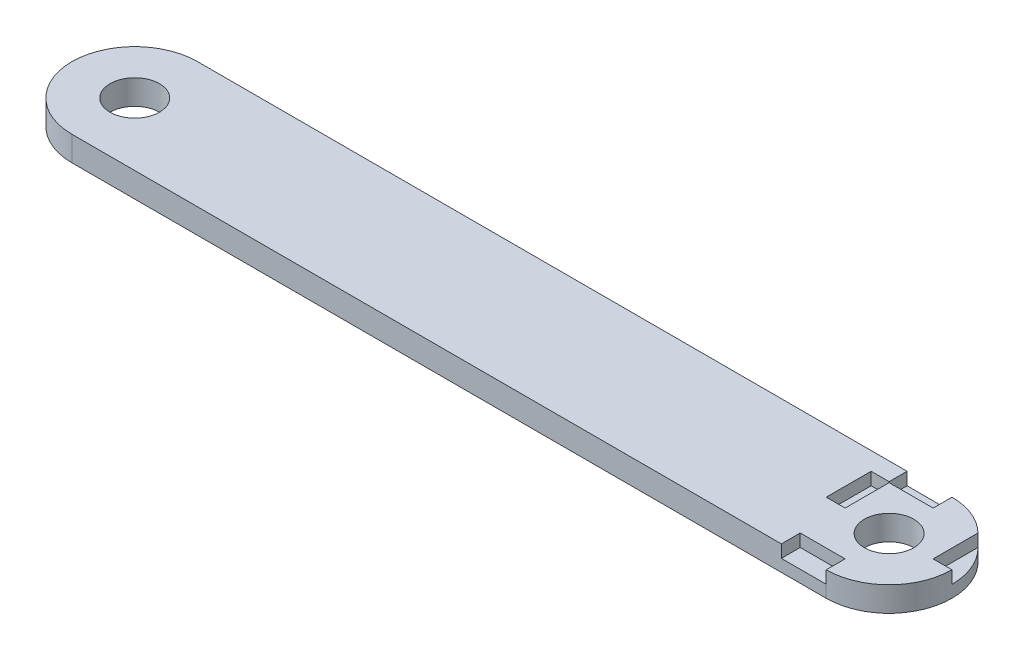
ISO-10303-21;
HEADER;
FILE_DESCRIPTION(('STEP AP214'),'2;1');
FILE_NAME('part.step','',(''),(''),'','','');
FILE_SCHEMA(('AUTOMOTIVE_DESIGN { 1 0 10303 214 1 1 1 1 }'));
ENDSEC;
DATA;
#1=APPLICATION_CONTEXT('core data for automotive mechanical design processes');
#2=APPLICATION_PROTOCOL_DEFINITION('international standard','automotive_design',2000,#1);
#3=PRODUCT_CONTEXT('',#1,'mechanical');
#4=PRODUCT('Part','Part','',(#3));
#5=PRODUCT_RELATED_PRODUCT_CATEGORY('part','',(#4));
#6=PRODUCT_DEFINITION_FORMATION('','',#4);
#7=PRODUCT_DEFINITION_CONTEXT('part definition',#1,'design');
#8=PRODUCT_DEFINITION('design','',#6,#7);
#9=PRODUCT_DEFINITION_SHAPE('','',#8);
#10=(LENGTH_UNIT() NAMED_UNIT(*) SI_UNIT(.MILLI.,.METRE.));
#11=(NAMED_UNIT(*) PLANE_ANGLE_UNIT() SI_UNIT($,.RADIAN.));
#12=(NAMED_UNIT(*) SI_UNIT($,.STERADIAN.) SOLID_ANGLE_UNIT());
#13=UNCERTAINTY_MEASURE_WITH_UNIT(LENGTH_MEASURE(1.E-05),#10,'distance_accuracy_value','');
#14=(GEOMETRIC_REPRESENTATION_CONTEXT(3) GLOBAL_UNCERTAINTY_ASSIGNED_CONTEXT((#13)) GLOBAL_UNIT_ASSIGNED_CONTEXT((#10,
#11,#12)) REPRESENTATION_CONTEXT('',''));
#15=CARTESIAN_POINT('',(0.,0.,0.));
#16=DIRECTION('',(0.,0.,1.));
#17=DIRECTION('',(1.,0.,0.));
#18=AXIS2_PLACEMENT_3D('',#15,#16,#17);
#19=CARTESIAN_POINT('',(-73.5541666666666,5.,1.32291666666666));
#20=DIRECTION('',(0.,-1.,0.));
#21=DIRECTION('',(0.,0.,-1.));
#22=AXIS2_PLACEMENT_3D('',#19,#20,#21);
#23=CYLINDRICAL_SURFACE('',#22,12.7);
#24=CARTESIAN_POINT('',(-73.5541666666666,0.,1.32291666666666));
#25=DIRECTION('',(0.,1.,0.));
#26=DIRECTION('',(0.,0.,-1.));
#27=AXIS2_PLACEMENT_3D('',#24,#25,#26);
#28=CIRCLE('',#27,12.7);
#29=CARTESIAN_POINT('',(-73.5541666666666,0.,-11.3770833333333));
#30=VERTEX_POINT('',#29);
#31=CARTESIAN_POINT('',(-73.5541666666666,0.,14.0229166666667));
#32=VERTEX_POINT('',#31);
#33=EDGE_CURVE('E279',#30,#32,#28,.T.);
#34=ORIENTED_EDGE('',*,*,#33,.T.);
#35=DIRECTION('',(0.,-1.,0.));
#36=VECTOR('',#35,1.);
#37=CARTESIAN_POINT('',(-73.5541666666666,5.,14.0229166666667));
#38=LINE('',#37,#36);
#39=CARTESIAN_POINT('',(-73.5541666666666,5.,14.0229166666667));
#40=VERTEX_POINT('',#39);
#41=EDGE_CURVE('E40',#40,#32,#38,.T.);
#42=ORIENTED_EDGE('',*,*,#41,.F.);
#43=CARTESIAN_POINT('',(-73.5541666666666,5.,1.32291666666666));
#44=DIRECTION('',(0.,1.,0.));
#45=DIRECTION('',(0.,0.,-1.));
#46=AXIS2_PLACEMENT_3D('',#43,#44,#45);
#47=CIRCLE('',#46,12.7);
#48=CARTESIAN_POINT('',(-73.5541666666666,5.,-11.3770833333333));
#49=VERTEX_POINT('',#48);
#50=EDGE_CURVE('E282',#49,#40,#47,.T.);
#51=ORIENTED_EDGE('',*,*,#50,.F.);
#52=DIRECTION('',(0.,-1.,0.));
#53=VECTOR('',#52,1.);
#54=CARTESIAN_POINT('',(-73.5541666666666,5.,-11.3770833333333));
#55=LINE('',#54,#53);
#56=EDGE_CURVE('E295',#49,#30,#55,.T.);
#57=ORIENTED_EDGE('',*,*,#56,.T.);
#58=EDGE_LOOP('',(#34,#42,#51,#57));
#59=FACE_BOUND('',#58,.T.);
#60=ADVANCED_FACE('F33',(#59),#23,.T.);
#61=CARTESIAN_POINT('',(-73.5541666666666,5.,14.0229166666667));
#62=DIRECTION('',(0.,0.,-1.));
#63=DIRECTION('',(-1.,0.,0.));
#64=AXIS2_PLACEMENT_3D('',#61,#62,#63);
#65=PLANE('',#64);
#66=DIRECTION('',(1.,0.,0.));
#67=VECTOR('',#66,1.);
#68=CARTESIAN_POINT('',(78.8458333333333,2.46,14.0229166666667));
#69=LINE('',#68,#67);
#70=CARTESIAN_POINT('',(69.776219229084,2.46,14.0229166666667));
#71=VERTEX_POINT('',#70);
#72=CARTESIAN_POINT('',(78.8458333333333,2.46,14.0229166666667));
#73=VERTEX_POINT('',#72);
#74=EDGE_CURVE('E222',#71,#73,#69,.T.);
#75=ORIENTED_EDGE('',*,*,#74,.F.);
#76=DIRECTION('',(0.,1.,0.));
#77=VECTOR('',#76,1.);
#78=CARTESIAN_POINT('',(69.776219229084,2.46,14.0229166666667));
#79=LINE('',#78,#77);
#80=CARTESIAN_POINT('',(69.776219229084,5.,14.0229166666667));
#81=VERTEX_POINT('',#80);
#82=EDGE_CURVE('E242',#71,#81,#79,.T.);
#83=ORIENTED_EDGE('',*,*,#82,.T.);
#84=DIRECTION('',(1.,0.,0.));
#85=VECTOR('',#84,1.);
#86=CARTESIAN_POINT('',(-73.5541666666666,5.,14.0229166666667));
#87=LINE('',#86,#85);
#88=EDGE_CURVE('E285',#40,#81,#87,.T.);
#89=ORIENTED_EDGE('',*,*,#88,.F.);
#90=ORIENTED_EDGE('',*,*,#41,.T.);
#91=DIRECTION('',(1.,0.,0.));
#92=VECTOR('',#91,1.);
#93=CARTESIAN_POINT('',(-73.5541666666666,0.,14.0229166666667));
#94=LINE('',#93,#92);
#95=CARTESIAN_POINT('',(78.8458333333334,0.,14.0229166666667));
#96=VERTEX_POINT('',#95);
#97=EDGE_CURVE('E298',#32,#96,#94,.T.);
#98=ORIENTED_EDGE('',*,*,#97,.T.);
#99=DIRECTION('',(0.,-1.,0.));
#100=VECTOR('',#99,1.);
#101=CARTESIAN_POINT('',(78.8458333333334,5.,14.0229166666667));
#102=LINE('',#101,#100);
#103=EDGE_CURVE('E310',#73,#96,#102,.T.);
#104=ORIENTED_EDGE('',*,*,#103,.F.);
#105=EDGE_LOOP('',(#75,#83,#89,#90,#98,#104));
#106=FACE_BOUND('',#105,.T.);
#107=ADVANCED_FACE('F317',(#106),#65,.F.);
#108=CARTESIAN_POINT('',(78.8458333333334,5.,1.32291666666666));
#109=DIRECTION('',(0.,-1.,0.));
#110=DIRECTION('',(0.,0.,-1.));
#111=AXIS2_PLACEMENT_3D('',#108,#109,#110);
#112=CYLINDRICAL_SURFACE('',#111,12.7);
#113=CARTESIAN_POINT('',(78.8458333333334,5.,1.32291666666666));
#114=DIRECTION('',(0.,1.,0.));
#115=DIRECTION('',(0.,0.,-1.));
#116=AXIS2_PLACEMENT_3D('',#113,#114,#115);
#117=CIRCLE('',#116,12.7);
#118=CARTESIAN_POINT('',(87.7358333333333,5.,-7.74669743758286));
#119=VERTEX_POINT('',#118);
#120=CARTESIAN_POINT('',(78.8458333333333,5.,-11.3770833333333));
#121=VERTEX_POINT('',#120);
#122=EDGE_CURVE('E289',#119,#121,#117,.T.);
#123=ORIENTED_EDGE('',*,*,#122,.F.);
#124=DIRECTION('',(0.,1.,0.));
#125=VECTOR('',#124,1.);
#126=CARTESIAN_POINT('',(87.7358333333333,2.46,-7.74669743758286));
#127=LINE('',#126,#125);
#128=CARTESIAN_POINT('',(87.7358333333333,2.46,-7.74669743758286));
#129=VERTEX_POINT('',#128);
#130=EDGE_CURVE('E47',#129,#119,#127,.T.);
#131=ORIENTED_EDGE('',*,*,#130,.F.);
#132=CARTESIAN_POINT('',(78.8458333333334,2.46,1.32291666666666));
#133=DIRECTION('',(0.,-1.,0.));
#134=DIRECTION('',(0.,0.,-1.));
#135=AXIS2_PLACEMENT_3D('',#132,#133,#134);
#136=CIRCLE('',#135,12.7);
#137=CARTESIAN_POINT('',(91.5458333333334,2.46,1.32291666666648));
#138=VERTEX_POINT('',#137);
#139=EDGE_CURVE('E11',#129,#138,#136,.T.);
#140=ORIENTED_EDGE('',*,*,#139,.T.);
#141=DIRECTION('',(0.,1.,0.));
#142=VECTOR('',#141,1.);
#143=CARTESIAN_POINT('',(91.5458333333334,2.46,1.32291666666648));
#144=LINE('',#143,#142);
#145=CARTESIAN_POINT('',(91.5458333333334,5.,1.32291666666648));
#146=VERTEX_POINT('',#145);
#147=EDGE_CURVE('E213',#138,#146,#144,.T.);
#148=ORIENTED_EDGE('',*,*,#147,.T.);
#149=CARTESIAN_POINT('',(78.8458333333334,5.,14.0229166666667));
#150=VERTEX_POINT('',#149);
#151=EDGE_CURVE('E290',#150,#146,#117,.T.);
#152=ORIENTED_EDGE('',*,*,#151,.F.);
#153=EDGE_CURVE('E311',#150,#73,#102,.T.);
#154=ORIENTED_EDGE('',*,*,#153,.T.);
#155=ORIENTED_EDGE('',*,*,#103,.T.);
#156=CARTESIAN_POINT('',(78.8458333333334,0.,1.32291666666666));
#157=DIRECTION('',(0.,1.,0.));
#158=DIRECTION('',(0.,0.,-1.));
#159=AXIS2_PLACEMENT_3D('',#156,#157,#158);
#160=CIRCLE('',#159,12.7);
#161=CARTESIAN_POINT('',(78.8458333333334,0.,-11.3770833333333));
#162=VERTEX_POINT('',#161);
#163=EDGE_CURVE('E301',#96,#162,#160,.T.);
#164=ORIENTED_EDGE('',*,*,#163,.T.);
#165=DIRECTION('',(0.,-1.,0.));
#166=VECTOR('',#165,1.);
#167=CARTESIAN_POINT('',(78.8458333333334,5.,-11.3770833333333));
#168=LINE('',#167,#166);
#169=CARTESIAN_POINT('',(78.8458333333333,2.46,-11.3770833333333));
#170=VERTEX_POINT('',#169);
#171=EDGE_CURVE('E307',#170,#162,#168,.T.);
#172=ORIENTED_EDGE('',*,*,#171,.F.);
#173=EDGE_CURVE('E308',#121,#170,#168,.T.);
#174=ORIENTED_EDGE('',*,*,#173,.F.);
#175=EDGE_LOOP('',(#123,#131,#140,#148,#152,#154,#155,#164,#172,#174));
#176=FACE_BOUND('',#175,.T.);
#177=ADVANCED_FACE('F330',(#176),#112,.T.);
#178=CARTESIAN_POINT('',(-73.5541666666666,5.,-11.3770833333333));
#179=DIRECTION('',(0.,0.,1.));
#180=DIRECTION('',(1.,0.,0.));
#181=AXIS2_PLACEMENT_3D('',#178,#179,#180);
#182=PLANE('',#181);
#183=DIRECTION('',(-1.,0.,0.));
#184=VECTOR('',#183,1.);
#185=CARTESIAN_POINT('',(-73.5541666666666,5.,-11.3770833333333));
#186=LINE('',#185,#184);
#187=CARTESIAN_POINT('',(69.7762192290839,5.,-11.3770833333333));
#188=VERTEX_POINT('',#187);
#189=EDGE_CURVE('E293',#188,#49,#186,.T.);
#190=ORIENTED_EDGE('',*,*,#189,.F.);
#191=DIRECTION('',(0.,1.,0.));
#192=VECTOR('',#191,1.);
#193=CARTESIAN_POINT('',(69.776219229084,2.46,-11.3770833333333));
#194=LINE('',#193,#192);
#195=CARTESIAN_POINT('',(69.776219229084,2.46,-11.3770833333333));
#196=VERTEX_POINT('',#195);
#197=EDGE_CURVE('E55',#196,#188,#194,.T.);
#198=ORIENTED_EDGE('',*,*,#197,.F.);
#199=DIRECTION('',(-1.,0.,0.));
#200=VECTOR('',#199,1.);
#201=CARTESIAN_POINT('',(78.8458333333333,2.46,-11.3770833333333));
#202=LINE('',#201,#200);
#203=EDGE_CURVE('E252',#170,#196,#202,.T.);
#204=ORIENTED_EDGE('',*,*,#203,.F.);
#205=ORIENTED_EDGE('',*,*,#171,.T.);
#206=DIRECTION('',(-1.,0.,0.));
#207=VECTOR('',#206,1.);
#208=CARTESIAN_POINT('',(-73.5541666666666,0.,-11.3770833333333));
#209=LINE('',#208,#207);
#210=EDGE_CURVE('E286',#162,#30,#209,.T.);
#211=ORIENTED_EDGE('',*,*,#210,.T.);
#212=ORIENTED_EDGE('',*,*,#56,.F.);
#213=EDGE_LOOP('',(#190,#198,#204,#205,#211,#212));
#214=FACE_BOUND('',#213,.T.);
#215=ADVANCED_FACE('F347',(#214),#182,.F.);
#216=CARTESIAN_POINT('',(-73.5541666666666,5.,1.32291666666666));
#217=DIRECTION('',(0.,-1.,0.));
#218=DIRECTION('',(0.,0.,-1.));
#219=AXIS2_PLACEMENT_3D('',#216,#217,#218);
#220=PLANE('',#219);
#221=CARTESIAN_POINT('',(78.8458333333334,5.,1.32291666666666));
#222=DIRECTION('',(0.,1.,0.));
#223=DIRECTION('',(0.,0.,1.));
#224=AXIS2_PLACEMENT_3D('',#221,#222,#223);
#225=CIRCLE('',#224,5.);
#226=CARTESIAN_POINT('',(78.8458333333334,5.,6.32291666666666));
#227=VERTEX_POINT('',#226);
#228=EDGE_CURVE('E270',#227,#227,#225,.T.);
#229=ORIENTED_EDGE('',*,*,#228,.F.);
#230=EDGE_LOOP('',(#229));
#231=FACE_BOUND('',#230,.T.);
#232=CARTESIAN_POINT('',(-73.5541666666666,5.,1.32291666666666));
#233=DIRECTION('',(0.,1.,0.));
#234=DIRECTION('',(0.,0.,1.));
#235=AXIS2_PLACEMENT_3D('',#232,#233,#234);
#236=CIRCLE('',#235,5.);
#237=CARTESIAN_POINT('',(-73.5541666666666,5.,6.32291666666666));
#238=VERTEX_POINT('',#237);
#239=EDGE_CURVE('E276',#238,#238,#236,.T.);
#240=ORIENTED_EDGE('',*,*,#239,.F.);
#241=EDGE_LOOP('',(#240));
#242=FACE_BOUND('',#241,.T.);
#243=DIRECTION('',(0.,0.,1.));
#244=VECTOR('',#243,1.);
#245=CARTESIAN_POINT('',(66.1458333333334,5.,1.32291666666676));
#246=LINE('',#245,#244);
#247=CARTESIAN_POINT('',(66.1458333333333,5.,-7.74669743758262));
#248=VERTEX_POINT('',#247);
#249=CARTESIAN_POINT('',(66.1458333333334,5.,1.32291666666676));
#250=VERTEX_POINT('',#249);
#251=EDGE_CURVE('E167',#248,#250,#246,.T.);
#252=ORIENTED_EDGE('',*,*,#251,.F.);
#253=DIRECTION('',(-1.,0.,0.));
#254=VECTOR('',#253,1.);
#255=CARTESIAN_POINT('',(66.1458333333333,5.,-7.74669743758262));
#256=LINE('',#255,#254);
#257=CARTESIAN_POINT('',(69.776219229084,5.,-7.74669743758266));
#258=VERTEX_POINT('',#257);
#259=EDGE_CURVE('E185',#258,#248,#256,.T.);
#260=ORIENTED_EDGE('',*,*,#259,.F.);
#261=DIRECTION('',(0.,0.,1.));
#262=VECTOR('',#261,1.);
#263=CARTESIAN_POINT('',(69.776219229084,5.,-11.3770833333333));
#264=LINE('',#263,#262);
#265=EDGE_CURVE('E262',#188,#258,#264,.T.);
#266=ORIENTED_EDGE('',*,*,#265,.F.);
#267=ORIENTED_EDGE('',*,*,#189,.T.);
#268=ORIENTED_EDGE('',*,*,#50,.T.);
#269=ORIENTED_EDGE('',*,*,#88,.T.);
#270=DIRECTION('',(0.,0.,1.));
#271=VECTOR('',#270,1.);
#272=CARTESIAN_POINT('',(69.776219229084,5.,14.0229166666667));
#273=LINE('',#272,#271);
#274=CARTESIAN_POINT('',(69.776219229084,5.,10.2129166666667));
#275=VERTEX_POINT('',#274);
#276=EDGE_CURVE('E226',#275,#81,#273,.T.);
#277=ORIENTED_EDGE('',*,*,#276,.F.);
#278=DIRECTION('',(-1.,0.,0.));
#279=VECTOR('',#278,1.);
#280=CARTESIAN_POINT('',(78.8458333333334,5.,10.2129166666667));
#281=LINE('',#280,#279);
#282=CARTESIAN_POINT('',(78.8458333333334,5.,10.2129166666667));
#283=VERTEX_POINT('',#282);
#284=EDGE_CURVE('E238',#283,#275,#281,.T.);
#285=ORIENTED_EDGE('',*,*,#284,.F.);
#286=DIRECTION('',(0.,0.,-1.));
#287=VECTOR('',#286,1.);
#288=CARTESIAN_POINT('',(78.8458333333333,5.,14.0229166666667));
#289=LINE('',#288,#287);
#290=EDGE_CURVE('E218',#150,#283,#289,.T.);
#291=ORIENTED_EDGE('',*,*,#290,.F.);
#292=ORIENTED_EDGE('',*,*,#151,.T.);
#293=DIRECTION('',(1.,0.,0.));
#294=VECTOR('',#293,1.);
#295=CARTESIAN_POINT('',(91.5458333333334,5.,1.32291666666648));
#296=LINE('',#295,#294);
#297=CARTESIAN_POINT('',(87.7358333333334,5.,1.32291666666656));
#298=VERTEX_POINT('',#297);
#299=EDGE_CURVE('E205',#298,#146,#296,.T.);
#300=ORIENTED_EDGE('',*,*,#299,.F.);
#301=DIRECTION('',(0.,0.,1.));
#302=VECTOR('',#301,1.);
#303=CARTESIAN_POINT('',(87.7358333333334,5.,1.32291666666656));
#304=LINE('',#303,#302);
#305=EDGE_CURVE('E210',#119,#298,#304,.T.);
#306=ORIENTED_EDGE('',*,*,#305,.F.);
#307=ORIENTED_EDGE('',*,*,#122,.T.);
#308=DIRECTION('',(0.,0.,-1.));
#309=VECTOR('',#308,1.);
#310=CARTESIAN_POINT('',(78.8458333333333,5.,-11.3770833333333));
#311=LINE('',#310,#309);
#312=CARTESIAN_POINT('',(78.8458333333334,5.,-7.56708333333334));
#313=VERTEX_POINT('',#312);
#314=EDGE_CURVE('E245',#313,#121,#311,.T.);
#315=ORIENTED_EDGE('',*,*,#314,.F.);
#316=DIRECTION('',(1.,0.,0.));
#317=VECTOR('',#316,1.);
#318=CARTESIAN_POINT('',(78.8458333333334,5.,-7.56708333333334));
#319=LINE('',#318,#317);
#320=CARTESIAN_POINT('',(69.9558333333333,5.,-7.56708333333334));
#321=VERTEX_POINT('',#320);
#322=EDGE_CURVE('E253',#321,#313,#319,.T.);
#323=ORIENTED_EDGE('',*,*,#322,.F.);
#324=DIRECTION('',(0.,0.,-1.));
#325=VECTOR('',#324,1.);
#326=CARTESIAN_POINT('',(69.9558333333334,5.,1.32291666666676));
#327=LINE('',#326,#325);
#328=CARTESIAN_POINT('',(69.9558333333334,5.,1.32291666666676));
#329=VERTEX_POINT('',#328);
#330=EDGE_CURVE('E187',#329,#321,#327,.T.);
#331=ORIENTED_EDGE('',*,*,#330,.F.);
#332=DIRECTION('',(1.,0.,0.));
#333=VECTOR('',#332,1.);
#334=CARTESIAN_POINT('',(66.1458333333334,5.,1.32291666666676));
#335=LINE('',#334,#333);
#336=EDGE_CURVE('E193',#250,#329,#335,.T.);
#337=ORIENTED_EDGE('',*,*,#336,.F.);
#338=EDGE_LOOP('',(#252,#260,#266,#267,#268,#269,#277,#285,#291,#292,#300,#306,#307,#315,#323,
#331,#337));
#339=FACE_BOUND('',#338,.T.);
#340=ADVANCED_FACE('F342',(#231,#242,#339),#220,.F.);
#341=CARTESIAN_POINT('',(-73.5541666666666,0.,1.32291666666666));
#342=DIRECTION('',(0.,-1.,0.));
#343=DIRECTION('',(0.,0.,-1.));
#344=AXIS2_PLACEMENT_3D('',#341,#342,#343);
#345=PLANE('',#344);
#346=CARTESIAN_POINT('',(78.8458333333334,0.,1.32291666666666));
#347=DIRECTION('',(0.,1.,0.));
#348=DIRECTION('',(0.,0.,1.));
#349=AXIS2_PLACEMENT_3D('',#346,#347,#348);
#350=CIRCLE('',#349,5.);
#351=CARTESIAN_POINT('',(78.8458333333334,0.,6.32291666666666));
#352=VERTEX_POINT('',#351);
#353=EDGE_CURVE('E268',#352,#352,#350,.T.);
#354=ORIENTED_EDGE('',*,*,#353,.T.);
#355=EDGE_LOOP('',(#354));
#356=FACE_BOUND('',#355,.T.);
#357=CARTESIAN_POINT('',(-73.5541666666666,0.,1.32291666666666));
#358=DIRECTION('',(0.,1.,0.));
#359=DIRECTION('',(0.,0.,1.));
#360=AXIS2_PLACEMENT_3D('',#357,#358,#359);
#361=CIRCLE('',#360,5.);
#362=CARTESIAN_POINT('',(-73.5541666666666,0.,6.32291666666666));
#363=VERTEX_POINT('',#362);
#364=EDGE_CURVE('E273',#363,#363,#361,.T.);
#365=ORIENTED_EDGE('',*,*,#364,.T.);
#366=EDGE_LOOP('',(#365));
#367=FACE_BOUND('',#366,.T.);
#368=ORIENTED_EDGE('',*,*,#33,.F.);
#369=ORIENTED_EDGE('',*,*,#210,.F.);
#370=ORIENTED_EDGE('',*,*,#163,.F.);
#371=ORIENTED_EDGE('',*,*,#97,.F.);
#372=EDGE_LOOP('',(#368,#369,#370,#371));
#373=FACE_BOUND('',#372,.T.);
#374=ADVANCED_FACE('F326',(#356,#367,#373),#345,.T.);
#375=CARTESIAN_POINT('',(-73.5541666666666,5.,1.32291666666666));
#376=DIRECTION('',(0.,-1.,0.));
#377=DIRECTION('',(0.,0.,-1.));
#378=AXIS2_PLACEMENT_3D('',#375,#376,#377);
#379=CYLINDRICAL_SURFACE('',#378,5.);
#380=ORIENTED_EDGE('',*,*,#239,.T.);
#381=EDGE_LOOP('',(#380));
#382=FACE_BOUND('',#381,.T.);
#383=ORIENTED_EDGE('',*,*,#364,.F.);
#384=EDGE_LOOP('',(#383));
#385=FACE_BOUND('',#384,.T.);
#386=ADVANCED_FACE('F389',(#382,#385),#379,.F.);
#387=CARTESIAN_POINT('',(78.8458333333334,5.,1.32291666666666));
#388=DIRECTION('',(0.,-1.,0.));
#389=DIRECTION('',(0.,0.,-1.));
#390=AXIS2_PLACEMENT_3D('',#387,#388,#389);
#391=CYLINDRICAL_SURFACE('',#390,5.);
#392=ORIENTED_EDGE('',*,*,#228,.T.);
#393=EDGE_LOOP('',(#392));
#394=FACE_BOUND('',#393,.T.);
#395=ORIENTED_EDGE('',*,*,#353,.F.);
#396=EDGE_LOOP('',(#395));
#397=FACE_BOUND('',#396,.T.);
#398=ADVANCED_FACE('F396',(#394,#397),#391,.F.);
#399=CARTESIAN_POINT('',(78.8458333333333,2.46,-11.3770833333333));
#400=DIRECTION('',(1.,0.,0.));
#401=DIRECTION('',(0.,0.,-1.));
#402=AXIS2_PLACEMENT_3D('',#399,#400,#401);
#403=PLANE('',#402);
#404=ORIENTED_EDGE('',*,*,#314,.T.);
#405=ORIENTED_EDGE('',*,*,#173,.T.);
#406=DIRECTION('',(0.,0.,-1.));
#407=VECTOR('',#406,1.);
#408=CARTESIAN_POINT('',(78.8458333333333,2.46,-11.3770833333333));
#409=LINE('',#408,#407);
#410=CARTESIAN_POINT('',(78.8458333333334,2.46,-7.56708333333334));
#411=VERTEX_POINT('',#410);
#412=EDGE_CURVE('E249',#411,#170,#409,.T.);
#413=ORIENTED_EDGE('',*,*,#412,.F.);
#414=DIRECTION('',(0.,1.,0.));
#415=VECTOR('',#414,1.);
#416=CARTESIAN_POINT('',(78.8458333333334,2.46,-7.56708333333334));
#417=LINE('',#416,#415);
#418=EDGE_CURVE('E265',#411,#313,#417,.T.);
#419=ORIENTED_EDGE('',*,*,#418,.T.);
#420=EDGE_LOOP('',(#404,#405,#413,#419));
#421=FACE_BOUND('',#420,.T.);
#422=ADVANCED_FACE('F353',(#421),#403,.F.);
#423=CARTESIAN_POINT('',(78.8458333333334,2.46,-7.56708333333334));
#424=DIRECTION('',(0.,0.,1.));
#425=DIRECTION('',(1.,0.,0.));
#426=AXIS2_PLACEMENT_3D('',#423,#424,#425);
#427=PLANE('',#426);
#428=DIRECTION('',(1.,0.,0.));
#429=VECTOR('',#428,1.);
#430=CARTESIAN_POINT('',(78.8458333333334,2.46,-7.56708333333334));
#431=LINE('',#430,#429);
#432=CARTESIAN_POINT('',(69.9558333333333,2.46,-7.56708333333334));
#433=VERTEX_POINT('',#432);
#434=EDGE_CURVE('E258',#433,#411,#431,.T.);
#435=ORIENTED_EDGE('',*,*,#434,.F.);
#436=DIRECTION('',(0.,1.,0.));
#437=VECTOR('',#436,1.);
#438=CARTESIAN_POINT('',(69.9558333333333,2.46,-7.56708333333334));
#439=LINE('',#438,#437);
#440=EDGE_CURVE('E198',#433,#321,#439,.T.);
#441=ORIENTED_EDGE('',*,*,#440,.T.);
#442=ORIENTED_EDGE('',*,*,#322,.T.);
#443=ORIENTED_EDGE('',*,*,#418,.F.);
#444=EDGE_LOOP('',(#435,#441,#442,#443));
#445=FACE_BOUND('',#444,.T.);
#446=ADVANCED_FACE('F403',(#445),#427,.F.);
#447=CARTESIAN_POINT('',(69.776219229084,2.46,-11.3770833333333));
#448=DIRECTION('',(-1.,0.,0.));
#449=DIRECTION('',(0.,0.,1.));
#450=AXIS2_PLACEMENT_3D('',#447,#448,#449);
#451=PLANE('',#450);
#452=ORIENTED_EDGE('',*,*,#265,.T.);
#453=DIRECTION('',(0.,-1.,0.));
#454=VECTOR('',#453,1.);
#455=CARTESIAN_POINT('',(69.776219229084,2.46,-7.74669743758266));
#456=LINE('',#455,#454);
#457=CARTESIAN_POINT('',(69.776219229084,2.46,-7.74669743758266));
#458=VERTEX_POINT('',#457);
#459=EDGE_CURVE('E202',#258,#458,#456,.T.);
#460=ORIENTED_EDGE('',*,*,#459,.T.);
#461=DIRECTION('',(0.,0.,1.));
#462=VECTOR('',#461,1.);
#463=CARTESIAN_POINT('',(69.776219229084,2.46,-11.3770833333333));
#464=LINE('',#463,#462);
#465=EDGE_CURVE('E256',#196,#458,#464,.T.);
#466=ORIENTED_EDGE('',*,*,#465,.F.);
#467=ORIENTED_EDGE('',*,*,#197,.T.);
#468=EDGE_LOOP('',(#452,#460,#466,#467));
#469=FACE_BOUND('',#468,.T.);
#470=ADVANCED_FACE('F404',(#469),#451,.F.);
#471=CARTESIAN_POINT('',(0.,2.46,0.));
#472=DIRECTION('',(0.,-1.,0.));
#473=DIRECTION('',(0.,0.,-1.));
#474=AXIS2_PLACEMENT_3D('',#471,#472,#473);
#475=PLANE('',#474);
#476=DIRECTION('',(0.,0.,-1.));
#477=VECTOR('',#476,1.);
#478=CARTESIAN_POINT('',(69.9558333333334,2.46,1.32291666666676));
#479=LINE('',#478,#477);
#480=CARTESIAN_POINT('',(69.9558333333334,2.46,1.32291666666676));
#481=VERTEX_POINT('',#480);
#482=EDGE_CURVE('E180',#481,#433,#479,.T.);
#483=ORIENTED_EDGE('',*,*,#482,.T.);
#484=ORIENTED_EDGE('',*,*,#434,.T.);
#485=ORIENTED_EDGE('',*,*,#412,.T.);
#486=ORIENTED_EDGE('',*,*,#203,.T.);
#487=ORIENTED_EDGE('',*,*,#465,.T.);
#488=DIRECTION('',(-1.,0.,0.));
#489=VECTOR('',#488,1.);
#490=CARTESIAN_POINT('',(66.1458333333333,2.46,-7.74669743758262));
#491=LINE('',#490,#489);
#492=CARTESIAN_POINT('',(66.1458333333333,2.46,-7.74669743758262));
#493=VERTEX_POINT('',#492);
#494=EDGE_CURVE('E172',#458,#493,#491,.T.);
#495=ORIENTED_EDGE('',*,*,#494,.T.);
#496=DIRECTION('',(0.,0.,1.));
#497=VECTOR('',#496,1.);
#498=CARTESIAN_POINT('',(66.1458333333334,2.46,1.32291666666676));
#499=LINE('',#498,#497);
#500=CARTESIAN_POINT('',(66.1458333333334,2.46,1.32291666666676));
#501=VERTEX_POINT('',#500);
#502=EDGE_CURVE('E165',#493,#501,#499,.T.);
#503=ORIENTED_EDGE('',*,*,#502,.T.);
#504=DIRECTION('',(1.,0.,0.));
#505=VECTOR('',#504,1.);
#506=CARTESIAN_POINT('',(66.1458333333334,2.46,1.32291666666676));
#507=LINE('',#506,#505);
#508=EDGE_CURVE('E175',#501,#481,#507,.T.);
#509=ORIENTED_EDGE('',*,*,#508,.T.);
#510=EDGE_LOOP('',(#483,#484,#485,#486,#487,#495,#503,#509));
#511=FACE_BOUND('',#510,.T.);
#512=ADVANCED_FACE('F182',(#511),#475,.F.);
#513=CARTESIAN_POINT('',(69.776219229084,2.46,14.0229166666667));
#514=DIRECTION('',(-1.,0.,0.));
#515=DIRECTION('',(0.,0.,1.));
#516=AXIS2_PLACEMENT_3D('',#513,#514,#515);
#517=PLANE('',#516);
#518=ORIENTED_EDGE('',*,*,#276,.T.);
#519=ORIENTED_EDGE('',*,*,#82,.F.);
#520=DIRECTION('',(0.,0.,1.));
#521=VECTOR('',#520,1.);
#522=CARTESIAN_POINT('',(69.776219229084,2.46,14.0229166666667));
#523=LINE('',#522,#521);
#524=CARTESIAN_POINT('',(69.776219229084,2.46,10.2129166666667));
#525=VERTEX_POINT('',#524);
#526=EDGE_CURVE('E232',#525,#71,#523,.T.);
#527=ORIENTED_EDGE('',*,*,#526,.F.);
#528=DIRECTION('',(0.,1.,0.));
#529=VECTOR('',#528,1.);
#530=CARTESIAN_POINT('',(69.776219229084,2.46,10.2129166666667));
#531=LINE('',#530,#529);
#532=EDGE_CURVE('E246',#525,#275,#531,.T.);
#533=ORIENTED_EDGE('',*,*,#532,.T.);
#534=EDGE_LOOP('',(#518,#519,#527,#533));
#535=FACE_BOUND('',#534,.T.);
#536=ADVANCED_FACE('F338',(#535),#517,.F.);
#537=CARTESIAN_POINT('',(78.8458333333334,2.46,10.2129166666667));
#538=DIRECTION('',(0.,0.,-1.));
#539=DIRECTION('',(-1.,0.,0.));
#540=AXIS2_PLACEMENT_3D('',#537,#538,#539);
#541=PLANE('',#540);
#542=ORIENTED_EDGE('',*,*,#284,.T.);
#543=ORIENTED_EDGE('',*,*,#532,.F.);
#544=DIRECTION('',(-1.,0.,0.));
#545=VECTOR('',#544,1.);
#546=CARTESIAN_POINT('',(78.8458333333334,2.46,10.2129166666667));
#547=LINE('',#546,#545);
#548=CARTESIAN_POINT('',(78.8458333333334,2.46,10.2129166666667));
#549=VERTEX_POINT('',#548);
#550=EDGE_CURVE('E229',#549,#525,#547,.T.);
#551=ORIENTED_EDGE('',*,*,#550,.F.);
#552=DIRECTION('',(0.,1.,0.));
#553=VECTOR('',#552,1.);
#554=CARTESIAN_POINT('',(78.8458333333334,2.46,10.2129166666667));
#555=LINE('',#554,#553);
#556=EDGE_CURVE('E235',#549,#283,#555,.T.);
#557=ORIENTED_EDGE('',*,*,#556,.T.);
#558=EDGE_LOOP('',(#542,#543,#551,#557));
#559=FACE_BOUND('',#558,.T.);
#560=ADVANCED_FACE('F366',(#559),#541,.F.);
#561=CARTESIAN_POINT('',(78.8458333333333,2.46,14.0229166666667));
#562=DIRECTION('',(1.,0.,0.));
#563=DIRECTION('',(0.,0.,-1.));
#564=AXIS2_PLACEMENT_3D('',#561,#562,#563);
#565=PLANE('',#564);
#566=ORIENTED_EDGE('',*,*,#290,.T.);
#567=ORIENTED_EDGE('',*,*,#556,.F.);
#568=DIRECTION('',(0.,0.,-1.));
#569=VECTOR('',#568,1.);
#570=CARTESIAN_POINT('',(78.8458333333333,2.46,14.0229166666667));
#571=LINE('',#570,#569);
#572=EDGE_CURVE('E225',#73,#549,#571,.T.);
#573=ORIENTED_EDGE('',*,*,#572,.F.);
#574=ORIENTED_EDGE('',*,*,#153,.F.);
#575=EDGE_LOOP('',(#566,#567,#573,#574));
#576=FACE_BOUND('',#575,.T.);
#577=ADVANCED_FACE('F364',(#576),#565,.F.);
#578=CARTESIAN_POINT('',(0.,2.46,0.));
#579=DIRECTION('',(0.,-1.,0.));
#580=DIRECTION('',(0.,0.,-1.));
#581=AXIS2_PLACEMENT_3D('',#578,#579,#580);
#582=PLANE('',#581);
#583=ORIENTED_EDGE('',*,*,#74,.T.);
#584=ORIENTED_EDGE('',*,*,#572,.T.);
#585=ORIENTED_EDGE('',*,*,#550,.T.);
#586=ORIENTED_EDGE('',*,*,#526,.T.);
#587=EDGE_LOOP('',(#583,#584,#585,#586));
#588=FACE_BOUND('',#587,.T.);
#589=ADVANCED_FACE('F334',(#588),#582,.F.);
#590=CARTESIAN_POINT('',(80.1687499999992,2.46,-77.5229166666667));
#591=DIRECTION('',(0.,-1.,0.));
#592=DIRECTION('',(1.,0.,0.));
#593=AXIS2_PLACEMENT_3D('',#590,#591,#592);
#594=PLANE('',#593);
#595=DIRECTION('',(0.,0.,1.));
#596=VECTOR('',#595,1.);
#597=CARTESIAN_POINT('',(87.7358333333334,2.46,1.32291666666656));
#598=LINE('',#597,#596);
#599=CARTESIAN_POINT('',(87.7358333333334,2.46,1.32291666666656));
#600=VERTEX_POINT('',#599);
#601=EDGE_CURVE('E209',#129,#600,#598,.T.);
#602=ORIENTED_EDGE('',*,*,#601,.T.);
#603=DIRECTION('',(1.,0.,0.));
#604=VECTOR('',#603,1.);
#605=CARTESIAN_POINT('',(91.5458333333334,2.46,1.32291666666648));
#606=LINE('',#605,#604);
#607=EDGE_CURVE('E206',#600,#138,#606,.T.);
#608=ORIENTED_EDGE('',*,*,#607,.T.);
#609=ORIENTED_EDGE('',*,*,#139,.F.);
#610=EDGE_LOOP('',(#602,#608,#609));
#611=FACE_BOUND('',#610,.T.);
#612=ADVANCED_FACE('F362',(#611),#594,.F.);
#613=CARTESIAN_POINT('',(91.5458333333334,2.46,1.32291666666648));
#614=DIRECTION('',(0.,0.,1.));
#615=DIRECTION('',(1.,0.,0.));
#616=AXIS2_PLACEMENT_3D('',#613,#614,#615);
#617=PLANE('',#616);
#618=ORIENTED_EDGE('',*,*,#299,.T.);
#619=ORIENTED_EDGE('',*,*,#147,.F.);
#620=ORIENTED_EDGE('',*,*,#607,.F.);
#621=DIRECTION('',(0.,1.,0.));
#622=VECTOR('',#621,1.);
#623=CARTESIAN_POINT('',(87.7358333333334,2.46,1.32291666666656));
#624=LINE('',#623,#622);
#625=EDGE_CURVE('E216',#600,#298,#624,.T.);
#626=ORIENTED_EDGE('',*,*,#625,.T.);
#627=EDGE_LOOP('',(#618,#619,#620,#626));
#628=FACE_BOUND('',#627,.T.);
#629=ADVANCED_FACE('F360',(#628),#617,.F.);
#630=CARTESIAN_POINT('',(87.7358333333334,2.46,1.32291666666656));
#631=DIRECTION('',(-1.,0.,0.));
#632=DIRECTION('',(0.,0.,1.));
#633=AXIS2_PLACEMENT_3D('',#630,#631,#632);
#634=PLANE('',#633);
#635=ORIENTED_EDGE('',*,*,#305,.T.);
#636=ORIENTED_EDGE('',*,*,#625,.F.);
#637=ORIENTED_EDGE('',*,*,#601,.F.);
#638=ORIENTED_EDGE('',*,*,#130,.T.);
#639=EDGE_LOOP('',(#635,#636,#637,#638));
#640=FACE_BOUND('',#639,.T.);
#641=ADVANCED_FACE('F357',(#640),#634,.F.);
#642=CARTESIAN_POINT('',(66.1458333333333,2.46,-7.74669743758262));
#643=DIRECTION('',(0.,0.,-1.));
#644=DIRECTION('',(-1.,0.,0.));
#645=AXIS2_PLACEMENT_3D('',#642,#643,#644);
#646=PLANE('',#645);
#647=ORIENTED_EDGE('',*,*,#259,.T.);
#648=DIRECTION('',(0.,1.,0.));
#649=VECTOR('',#648,1.);
#650=CARTESIAN_POINT('',(66.1458333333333,2.46,-7.74669743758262));
#651=LINE('',#650,#649);
#652=EDGE_CURVE('E196',#493,#248,#651,.T.);
#653=ORIENTED_EDGE('',*,*,#652,.F.);
#654=ORIENTED_EDGE('',*,*,#494,.F.);
#655=ORIENTED_EDGE('',*,*,#459,.F.);
#656=EDGE_LOOP('',(#647,#653,#654,#655));
#657=FACE_BOUND('',#656,.T.);
#658=ADVANCED_FACE('F434',(#657),#646,.F.);
#659=CARTESIAN_POINT('',(69.9558333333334,2.46,1.32291666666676));
#660=DIRECTION('',(1.,0.,0.));
#661=DIRECTION('',(0.,0.,-1.));
#662=AXIS2_PLACEMENT_3D('',#659,#660,#661);
#663=PLANE('',#662);
#664=ORIENTED_EDGE('',*,*,#482,.F.);
#665=DIRECTION('',(0.,1.,0.));
#666=VECTOR('',#665,1.);
#667=CARTESIAN_POINT('',(69.9558333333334,2.46,1.32291666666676));
#668=LINE('',#667,#666);
#669=EDGE_CURVE('E171',#481,#329,#668,.T.);
#670=ORIENTED_EDGE('',*,*,#669,.T.);
#671=ORIENTED_EDGE('',*,*,#330,.T.);
#672=ORIENTED_EDGE('',*,*,#440,.F.);
#673=EDGE_LOOP('',(#664,#670,#671,#672));
#674=FACE_BOUND('',#673,.T.);
#675=ADVANCED_FACE('F441',(#674),#663,.F.);
#676=CARTESIAN_POINT('',(66.1458333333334,2.46,1.32291666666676));
#677=DIRECTION('',(-1.,0.,0.));
#678=DIRECTION('',(0.,0.,1.));
#679=AXIS2_PLACEMENT_3D('',#676,#677,#678);
#680=PLANE('',#679);
#681=ORIENTED_EDGE('',*,*,#251,.T.);
#682=DIRECTION('',(0.,1.,0.));
#683=VECTOR('',#682,1.);
#684=CARTESIAN_POINT('',(66.1458333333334,2.46,1.32291666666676));
#685=LINE('',#684,#683);
#686=EDGE_CURVE('E160',#501,#250,#685,.T.);
#687=ORIENTED_EDGE('',*,*,#686,.F.);
#688=ORIENTED_EDGE('',*,*,#502,.F.);
#689=ORIENTED_EDGE('',*,*,#652,.T.);
#690=EDGE_LOOP('',(#681,#687,#688,#689));
#691=FACE_BOUND('',#690,.T.);
#692=ADVANCED_FACE('F162',(#691),#680,.F.);
#693=CARTESIAN_POINT('',(66.1458333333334,2.46,1.32291666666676));
#694=DIRECTION('',(0.,0.,1.));
#695=DIRECTION('',(1.,0.,0.));
#696=AXIS2_PLACEMENT_3D('',#693,#694,#695);
#697=PLANE('',#696);
#698=ORIENTED_EDGE('',*,*,#336,.T.);
#699=ORIENTED_EDGE('',*,*,#669,.F.);
#700=ORIENTED_EDGE('',*,*,#508,.F.);
#701=ORIENTED_EDGE('',*,*,#686,.T.);
#702=EDGE_LOOP('',(#698,#699,#700,#701));
#703=FACE_BOUND('',#702,.T.);
#704=ADVANCED_FACE('F176',(#703),#697,.F.);
#705=CLOSED_SHELL('',(#60,#107,#177,#215,#340,#374,#386,#398,#422,#446,#470,#512,#536,#560,#577,
#589,#612,#629,#641,#658,#675,#692,#704));
#706=MANIFOLD_SOLID_BREP('B2',#705);
#707=ADVANCED_BREP_SHAPE_REPRESENTATION('',(#18,#706),#14);
#708=SHAPE_DEFINITION_REPRESENTATION(#9,#707);
ENDSEC;
END-ISO-10303-21;
